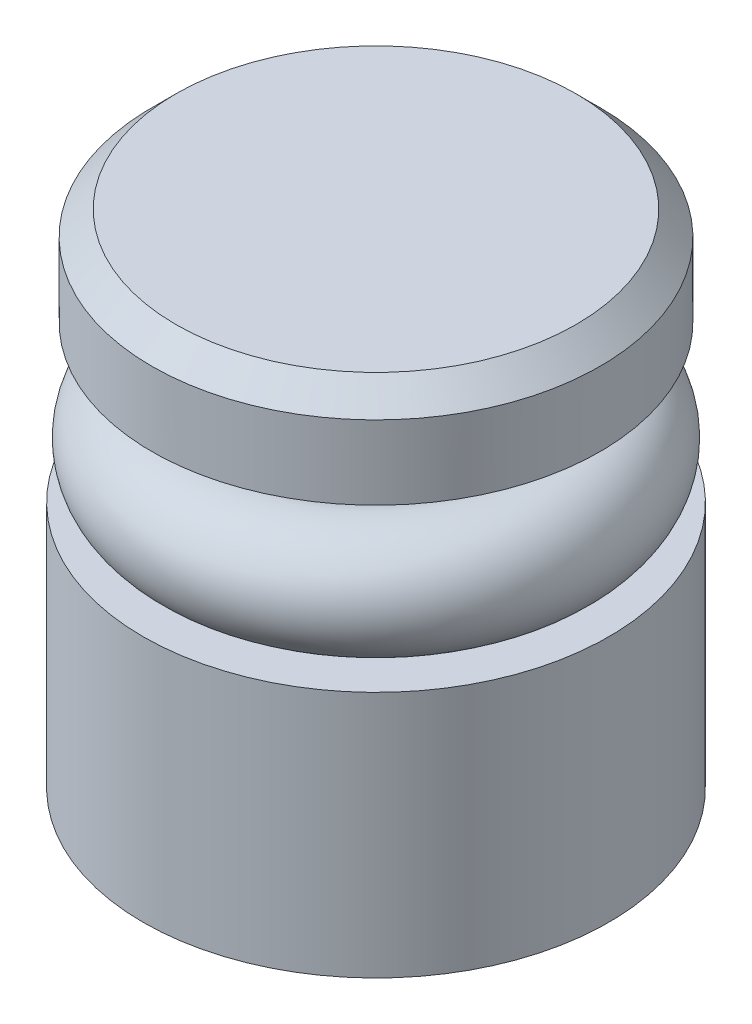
ISO-10303-21;
HEADER;
FILE_DESCRIPTION(('STEP AP214'),'2;1');
FILE_NAME('part.step','',(''),(''),'','','');
FILE_SCHEMA(('AUTOMOTIVE_DESIGN { 1 0 10303 214 1 1 1 1 }'));
ENDSEC;
DATA;
#1=APPLICATION_CONTEXT('core data for automotive mechanical design processes');
#2=APPLICATION_PROTOCOL_DEFINITION('international standard','automotive_design',2000,#1);
#3=PRODUCT_CONTEXT('',#1,'mechanical');
#4=PRODUCT('Part','Part','',(#3));
#5=PRODUCT_RELATED_PRODUCT_CATEGORY('part','',(#4));
#6=PRODUCT_DEFINITION_FORMATION('','',#4);
#7=PRODUCT_DEFINITION_CONTEXT('part definition',#1,'design');
#8=PRODUCT_DEFINITION('design','',#6,#7);
#9=PRODUCT_DEFINITION_SHAPE('','',#8);
#10=(LENGTH_UNIT() NAMED_UNIT(*) SI_UNIT(.MILLI.,.METRE.));
#11=(NAMED_UNIT(*) PLANE_ANGLE_UNIT() SI_UNIT($,.RADIAN.));
#12=(NAMED_UNIT(*) SI_UNIT($,.STERADIAN.) SOLID_ANGLE_UNIT());
#13=UNCERTAINTY_MEASURE_WITH_UNIT(LENGTH_MEASURE(1.E-05),#10,'distance_accuracy_value','');
#14=(GEOMETRIC_REPRESENTATION_CONTEXT(3) GLOBAL_UNCERTAINTY_ASSIGNED_CONTEXT((#13)) GLOBAL_UNIT_ASSIGNED_CONTEXT((#10,
#11,#12)) REPRESENTATION_CONTEXT('',''));
#15=CARTESIAN_POINT('',(0.,0.,0.));
#16=DIRECTION('',(0.,0.,1.));
#17=DIRECTION('',(1.,0.,0.));
#18=AXIS2_PLACEMENT_3D('',#15,#16,#17);
#19=CARTESIAN_POINT('',(0.,0.,0.));
#20=DIRECTION('',(0.,-1.,0.));
#21=DIRECTION('',(0.,0.,-1.));
#22=AXIS2_PLACEMENT_3D('',#19,#20,#21);
#23=PLANE('',#22);
#24=CARTESIAN_POINT('',(0.,0.,0.));
#25=DIRECTION('',(0.,-1.,0.));
#26=DIRECTION('',(0.,0.,-1.));
#27=AXIS2_PLACEMENT_3D('',#24,#25,#26);
#28=CIRCLE('',#27,1.35254999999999);
#29=CARTESIAN_POINT('',(0.,0.,-1.35254999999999));
#30=VERTEX_POINT('',#29);
#31=EDGE_CURVE('P0_E36',#30,#30,#28,.T.);
#32=ORIENTED_EDGE('',*,*,#31,.F.);
#33=EDGE_LOOP('',(#32));
#34=FACE_BOUND('',#33,.T.);
#35=CARTESIAN_POINT('',(0.,0.,0.));
#36=DIRECTION('',(0.,-1.,0.));
#37=DIRECTION('',(0.,0.,-1.));
#38=AXIS2_PLACEMENT_3D('',#35,#36,#37);
#39=CIRCLE('',#38,3.683);
#40=CARTESIAN_POINT('',(0.,0.,-3.683));
#41=VERTEX_POINT('',#40);
#42=EDGE_CURVE('P0_E52',#41,#41,#39,.T.);
#43=ORIENTED_EDGE('',*,*,#42,.T.);
#44=EDGE_LOOP('',(#43));
#45=FACE_BOUND('',#44,.T.);
#46=ADVANCED_FACE('P0_F15',(#34,#45),#23,.T.);
#47=CARTESIAN_POINT('',(0.,0.,0.));
#48=DIRECTION('',(0.,-1.,0.));
#49=DIRECTION('',(0.,0.,-1.));
#50=AXIS2_PLACEMENT_3D('',#47,#48,#49);
#51=CYLINDRICAL_SURFACE('',#50,3.683);
#52=CARTESIAN_POINT('',(0.,3.9116,0.));
#53=DIRECTION('',(0.,-1.,0.));
#54=DIRECTION('',(0.,0.,-1.));
#55=AXIS2_PLACEMENT_3D('',#52,#53,#54);
#56=CIRCLE('',#55,3.683);
#57=CARTESIAN_POINT('',(0.,3.9116,-3.683));
#58=VERTEX_POINT('',#57);
#59=EDGE_CURVE('P0_E49',#58,#58,#56,.T.);
#60=ORIENTED_EDGE('',*,*,#59,.T.);
#61=EDGE_LOOP('',(#60));
#62=FACE_BOUND('',#61,.T.);
#63=ORIENTED_EDGE('',*,*,#42,.F.);
#64=EDGE_LOOP('',(#63));
#65=FACE_BOUND('',#64,.T.);
#66=ADVANCED_FACE('P0_F69',(#62,#65),#51,.T.);
#67=CARTESIAN_POINT('',(3.683,3.9116,0.));
#68=DIRECTION('',(0.,1.,0.));
#69=DIRECTION('',(0.,0.,1.));
#70=AXIS2_PLACEMENT_3D('',#67,#68,#69);
#71=PLANE('',#70);
#72=CARTESIAN_POINT('',(0.,3.9116,0.));
#73=DIRECTION('',(0.,-1.,0.));
#74=DIRECTION('',(0.,0.,-1.));
#75=AXIS2_PLACEMENT_3D('',#72,#73,#74);
#76=CIRCLE('',#75,2.1971);
#77=CARTESIAN_POINT('',(0.,3.9116,-2.1971));
#78=VERTEX_POINT('',#77);
#79=EDGE_CURVE('P0_E46',#78,#78,#76,.T.);
#80=ORIENTED_EDGE('',*,*,#79,.T.);
#81=EDGE_LOOP('',(#80));
#82=FACE_BOUND('',#81,.T.);
#83=ORIENTED_EDGE('',*,*,#59,.F.);
#84=EDGE_LOOP('',(#83));
#85=FACE_BOUND('',#84,.T.);
#86=ADVANCED_FACE('P0_F74',(#82,#85),#71,.T.);
#87=CARTESIAN_POINT('',(0.,0.,0.));
#88=DIRECTION('',(0.,-1.,0.));
#89=DIRECTION('',(0.,0.,-1.));
#90=AXIS2_PLACEMENT_3D('',#87,#88,#89);
#91=CYLINDRICAL_SURFACE('',#90,2.1971);
#92=CARTESIAN_POINT('',(0.,6.3754,0.));
#93=DIRECTION('',(0.,-1.,0.));
#94=DIRECTION('',(0.,0.,-1.));
#95=AXIS2_PLACEMENT_3D('',#92,#93,#94);
#96=CIRCLE('',#95,2.1971);
#97=CARTESIAN_POINT('',(0.,6.3754,-2.1971));
#98=VERTEX_POINT('',#97);
#99=EDGE_CURVE('P0_E39',#98,#98,#96,.T.);
#100=ORIENTED_EDGE('',*,*,#99,.T.);
#101=EDGE_LOOP('',(#100));
#102=FACE_BOUND('',#101,.T.);
#103=ORIENTED_EDGE('',*,*,#79,.F.);
#104=EDGE_LOOP('',(#103));
#105=FACE_BOUND('',#104,.T.);
#106=ADVANCED_FACE('P0_F82',(#102,#105),#91,.T.);
#107=CARTESIAN_POINT('',(2.1971,6.3754,0.));
#108=DIRECTION('',(0.,-1.,0.));
#109=DIRECTION('',(0.,0.,-1.));
#110=AXIS2_PLACEMENT_3D('',#107,#108,#109);
#111=PLANE('',#110);
#112=CARTESIAN_POINT('',(0.,6.3754,0.));
#113=DIRECTION('',(0.,-1.,0.));
#114=DIRECTION('',(0.,0.,-1.));
#115=AXIS2_PLACEMENT_3D('',#112,#113,#114);
#116=CIRCLE('',#115,3.5433);
#117=CARTESIAN_POINT('',(0.,6.3754,-3.5433));
#118=VERTEX_POINT('',#117);
#119=EDGE_CURVE('P0_E35',#118,#118,#116,.T.);
#120=ORIENTED_EDGE('',*,*,#119,.T.);
#121=EDGE_LOOP('',(#120));
#122=FACE_BOUND('',#121,.T.);
#123=ORIENTED_EDGE('',*,*,#99,.F.);
#124=EDGE_LOOP('',(#123));
#125=FACE_BOUND('',#124,.T.);
#126=ADVANCED_FACE('P0_F86',(#122,#125),#111,.T.);
#127=CARTESIAN_POINT('',(0.,0.,0.));
#128=DIRECTION('',(0.,-1.,0.));
#129=DIRECTION('',(0.,0.,-1.));
#130=AXIS2_PLACEMENT_3D('',#127,#128,#129);
#131=CYLINDRICAL_SURFACE('',#130,3.5433);
#132=CARTESIAN_POINT('',(0.,7.5438,0.));
#133=DIRECTION('',(0.,1.,0.));
#134=DIRECTION('',(0.,0.,1.));
#135=AXIS2_PLACEMENT_3D('',#132,#133,#134);
#136=CIRCLE('',#135,3.5433);
#137=CARTESIAN_POINT('',(0.,7.5438,3.5433));
#138=VERTEX_POINT('',#137);
#139=EDGE_CURVE('P0_E22',#138,#138,#136,.F.);
#140=ORIENTED_EDGE('',*,*,#139,.T.);
#141=EDGE_LOOP('',(#140));
#142=FACE_BOUND('',#141,.T.);
#143=ORIENTED_EDGE('',*,*,#119,.F.);
#144=EDGE_LOOP('',(#143));
#145=FACE_BOUND('',#144,.T.);
#146=ADVANCED_FACE('P0_F57',(#142,#145),#131,.T.);
#147=CARTESIAN_POINT('',(3.5433,7.9248,0.));
#148=DIRECTION('',(0.,1.,0.));
#149=DIRECTION('',(0.,0.,1.));
#150=AXIS2_PLACEMENT_3D('',#147,#148,#149);
#151=PLANE('',#150);
#152=CARTESIAN_POINT('',(0.,7.9248,0.));
#153=DIRECTION('',(0.,1.,0.));
#154=DIRECTION('',(0.,0.,1.));
#155=AXIS2_PLACEMENT_3D('',#152,#153,#154);
#156=CIRCLE('',#155,3.1623);
#157=CARTESIAN_POINT('',(0.,7.9248,3.1623));
#158=VERTEX_POINT('',#157);
#159=EDGE_CURVE('P0_E10',#158,#158,#156,.T.);
#160=ORIENTED_EDGE('',*,*,#159,.T.);
#161=EDGE_LOOP('',(#160));
#162=FACE_BOUND('',#161,.T.);
#163=ADVANCED_FACE('P0_F29',(#162),#151,.T.);
#164=CARTESIAN_POINT('',(0.,3.81,0.));
#165=DIRECTION('',(0.,-1.,0.));
#166=DIRECTION('',(0.,0.,-1.));
#167=AXIS2_PLACEMENT_3D('',#164,#165,#166);
#168=CONICAL_SURFACE('',#167,1.35255,1.02974425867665);
#169=CARTESIAN_POINT('',(0.,4.62269403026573,0.));
#170=VERTEX_POINT('',#169);
#171=VERTEX_LOOP('',#170);
#172=FACE_BOUND('',#171,.T.);
#173=CARTESIAN_POINT('',(0.,3.81,0.));
#174=DIRECTION('',(0.,-1.,0.));
#175=DIRECTION('',(0.,0.,-1.));
#176=AXIS2_PLACEMENT_3D('',#173,#174,#175);
#177=CIRCLE('',#176,1.35255);
#178=CARTESIAN_POINT('',(0.,3.81,-1.35255));
#179=VERTEX_POINT('',#178);
#180=EDGE_CURVE('P0_E33',#179,#179,#177,.T.);
#181=ORIENTED_EDGE('',*,*,#180,.T.);
#182=EDGE_LOOP('',(#181));
#183=FACE_BOUND('',#182,.T.);
#184=ADVANCED_FACE('P0_F25',(#172,#183),#168,.F.);
#185=CARTESIAN_POINT('',(0.,0.,0.));
#186=DIRECTION('',(0.,-1.,0.));
#187=DIRECTION('',(0.,0.,-1.));
#188=AXIS2_PLACEMENT_3D('',#185,#186,#187);
#189=CYLINDRICAL_SURFACE('',#188,1.35254999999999);
#190=ORIENTED_EDGE('',*,*,#180,.F.);
#191=EDGE_LOOP('',(#190));
#192=FACE_BOUND('',#191,.T.);
#193=ORIENTED_EDGE('',*,*,#31,.T.);
#194=EDGE_LOOP('',(#193));
#195=FACE_BOUND('',#194,.T.);
#196=ADVANCED_FACE('P0_F28',(#192,#195),#189,.F.);
#197=CARTESIAN_POINT('',(0.,7.5438,0.));
#198=DIRECTION('',(0.,-1.,0.));
#199=DIRECTION('',(0.,0.,-1.));
#200=AXIS2_PLACEMENT_3D('',#197,#198,#199);
#201=CONICAL_SURFACE('',#200,3.5433,0.785398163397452);
#202=ORIENTED_EDGE('',*,*,#159,.F.);
#203=EDGE_LOOP('',(#202));
#204=FACE_BOUND('',#203,.T.);
#205=ORIENTED_EDGE('',*,*,#139,.F.);
#206=EDGE_LOOP('',(#205));
#207=FACE_BOUND('',#206,.T.);
#208=ADVANCED_FACE('P0_F17',(#204,#207),#201,.T.);
#209=CLOSED_SHELL('',(#46,#66,#86,#106,#126,#146,#163,#184,#196,#208));
#210=MANIFOLD_SOLID_BREP('P0_B1',#209);
#211=CARTESIAN_POINT('',(0.,4.8006,0.));
#212=DIRECTION('',(0.,-1.,0.));
#213=DIRECTION('',(0.,0.,-1.));
#214=AXIS2_PLACEMENT_3D('',#211,#212,#213);
#215=TOROIDAL_SURFACE('',#214,2.7305,0.888999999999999);
#216=CARTESIAN_POINT('',(0.,4.8006,-3.6195));
#217=VERTEX_POINT('',#216);
#218=VERTEX_LOOP('',#217);
#219=FACE_BOUND('',#218,.T.);
#220=ADVANCED_FACE('P1_F12',(#219),#215,.T.);
#221=CLOSED_SHELL('',(#220));
#222=MANIFOLD_SOLID_BREP('P1_B1',#221);
#223=ADVANCED_BREP_SHAPE_REPRESENTATION('',(#18,#210,#222),#14);
#224=SHAPE_DEFINITION_REPRESENTATION(#9,#223);
ENDSEC;
END-ISO-10303-21;
